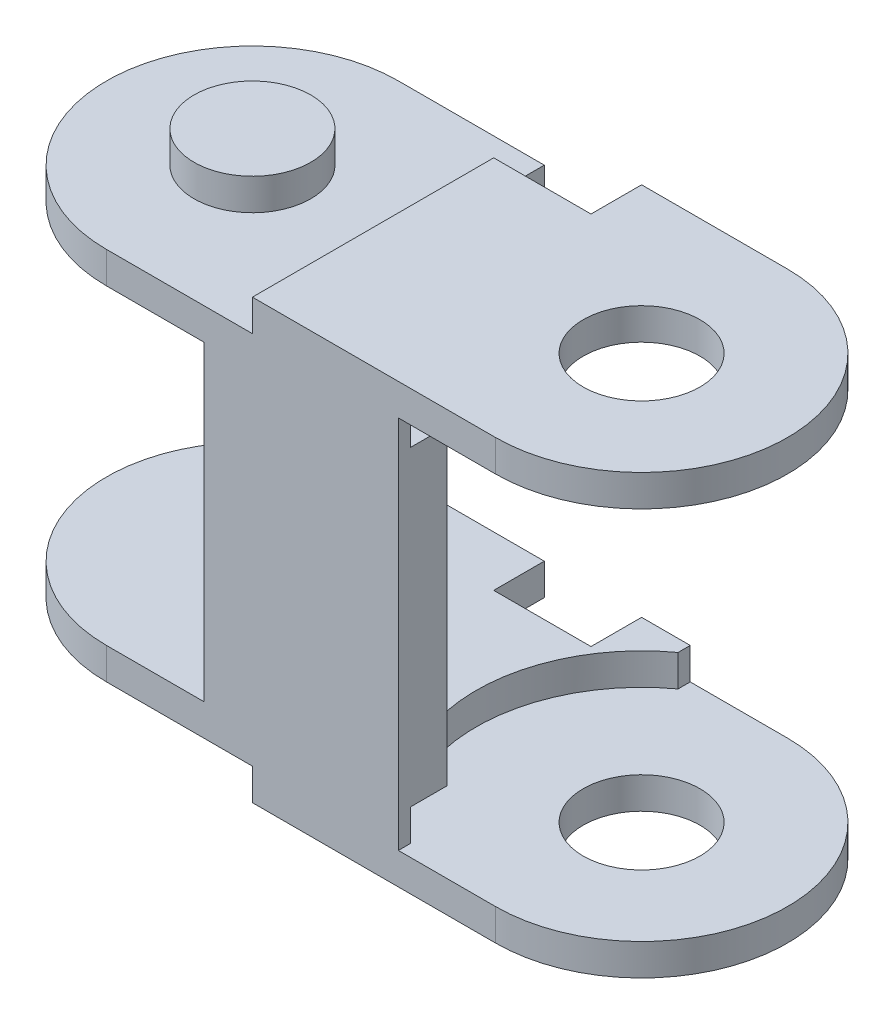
ISO-10303-21;
HEADER;
FILE_DESCRIPTION(('STEP AP214'),'2;1');
FILE_NAME('part.step','',(''),(''),'','','');
FILE_SCHEMA(('AUTOMOTIVE_DESIGN { 1 0 10303 214 1 1 1 1 }'));
ENDSEC;
DATA;
#1=APPLICATION_CONTEXT('core data for automotive mechanical design processes');
#2=APPLICATION_PROTOCOL_DEFINITION('international standard','automotive_design',2000,#1);
#3=PRODUCT_CONTEXT('',#1,'mechanical');
#4=PRODUCT('Part','Part','',(#3));
#5=PRODUCT_RELATED_PRODUCT_CATEGORY('part','',(#4));
#6=PRODUCT_DEFINITION_FORMATION('','',#4);
#7=PRODUCT_DEFINITION_CONTEXT('part definition',#1,'design');
#8=PRODUCT_DEFINITION('design','',#6,#7);
#9=PRODUCT_DEFINITION_SHAPE('','',#8);
#10=(LENGTH_UNIT() NAMED_UNIT(*) SI_UNIT(.MILLI.,.METRE.));
#11=(NAMED_UNIT(*) PLANE_ANGLE_UNIT() SI_UNIT($,.RADIAN.));
#12=(NAMED_UNIT(*) SI_UNIT($,.STERADIAN.) SOLID_ANGLE_UNIT());
#13=UNCERTAINTY_MEASURE_WITH_UNIT(LENGTH_MEASURE(1.E-05),#10,'distance_accuracy_value','');
#14=(GEOMETRIC_REPRESENTATION_CONTEXT(3) GLOBAL_UNCERTAINTY_ASSIGNED_CONTEXT((#13)) GLOBAL_UNIT_ASSIGNED_CONTEXT((#10,
#11,#12)) REPRESENTATION_CONTEXT('',''));
#15=CARTESIAN_POINT('',(0.,0.,0.));
#16=DIRECTION('',(0.,0.,1.));
#17=DIRECTION('',(1.,0.,0.));
#18=AXIS2_PLACEMENT_3D('',#15,#16,#17);
#19=CARTESIAN_POINT('',(-20.,19.25,0.));
#20=DIRECTION('',(0.,1.,0.));
#21=DIRECTION('',(0.,0.,1.));
#22=AXIS2_PLACEMENT_3D('',#19,#20,#21);
#23=PLANE('',#22);
#24=CARTESIAN_POINT('',(-20.,19.25,0.));
#25=DIRECTION('',(0.,-1.,0.));
#26=DIRECTION('',(0.,0.,-1.));
#27=AXIS2_PLACEMENT_3D('',#24,#25,#26);
#28=CIRCLE('',#27,3.);
#29=CARTESIAN_POINT('',(-20.,19.25,-3.));
#30=VERTEX_POINT('',#29);
#31=EDGE_CURVE('E19',#30,#30,#28,.T.);
#32=ORIENTED_EDGE('',*,*,#31,.F.);
#33=EDGE_LOOP('',(#32));
#34=FACE_BOUND('',#33,.T.);
#35=ADVANCED_FACE('F16',(#34),#23,.T.);
#36=CARTESIAN_POINT('',(-5.,8.,6.25));
#37=DIRECTION('',(-1.,0.,0.));
#38=DIRECTION('',(0.,0.,1.));
#39=AXIS2_PLACEMENT_3D('',#36,#37,#38);
#40=PLANE('',#39);
#41=DIRECTION('',(0.,0.,1.));
#42=VECTOR('',#41,1.);
#43=CARTESIAN_POINT('',(-5.,16.,6.25));
#44=LINE('',#43,#42);
#45=CARTESIAN_POINT('',(-5.,16.,-7.5));
#46=VERTEX_POINT('',#45);
#47=CARTESIAN_POINT('',(-5.,16.,-6.87386354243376));
#48=VERTEX_POINT('',#47);
#49=EDGE_CURVE('E176',#46,#48,#44,.T.);
#50=ORIENTED_EDGE('',*,*,#49,.F.);
#51=DIRECTION('',(0.,1.,0.));
#52=VECTOR('',#51,1.);
#53=CARTESIAN_POINT('',(-5.,19.25,-7.5));
#54=LINE('',#53,#52);
#55=CARTESIAN_POINT('',(-5.,17.625,-7.5));
#56=VERTEX_POINT('',#55);
#57=EDGE_CURVE('E284',#56,#46,#54,.F.);
#58=ORIENTED_EDGE('',*,*,#57,.F.);
#59=DIRECTION('',(0.,0.,1.));
#60=VECTOR('',#59,1.);
#61=CARTESIAN_POINT('',(-5.,17.625,6.25));
#62=LINE('',#61,#60);
#63=CARTESIAN_POINT('',(-5.,17.625,-6.87386354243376));
#64=VERTEX_POINT('',#63);
#65=EDGE_CURVE('E367',#64,#56,#62,.F.);
#66=ORIENTED_EDGE('',*,*,#65,.F.);
#67=DIRECTION('',(0.,1.,0.));
#68=VECTOR('',#67,1.);
#69=CARTESIAN_POINT('',(-5.,8.,-6.87386354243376));
#70=LINE('',#69,#68);
#71=EDGE_CURVE('E159',#64,#48,#70,.F.);
#72=ORIENTED_EDGE('',*,*,#71,.T.);
#73=EDGE_LOOP('',(#50,#58,#66,#72));
#74=FACE_BOUND('',#73,.T.);
#75=ADVANCED_FACE('F611',(#74),#40,.F.);
#76=CARTESIAN_POINT('',(-20.,-3.25,0.));
#77=DIRECTION('',(0.,-1.,0.));
#78=DIRECTION('',(0.,0.,-1.));
#79=AXIS2_PLACEMENT_3D('',#76,#77,#78);
#80=PLANE('',#79);
#81=CARTESIAN_POINT('',(-20.,-3.25,0.));
#82=DIRECTION('',(0.,-1.,0.));
#83=DIRECTION('',(0.,0.,-1.));
#84=AXIS2_PLACEMENT_3D('',#81,#82,#83);
#85=CIRCLE('',#84,3.);
#86=CARTESIAN_POINT('',(-20.,-3.25,-3.));
#87=VERTEX_POINT('',#86);
#88=EDGE_CURVE('E221',#87,#87,#85,.F.);
#89=ORIENTED_EDGE('',*,*,#88,.F.);
#90=EDGE_LOOP('',(#89));
#91=FACE_BOUND('',#90,.T.);
#92=ADVANCED_FACE('F1064',(#91),#80,.T.);
#93=CARTESIAN_POINT('',(-5.,8.,6.25));
#94=DIRECTION('',(-1.,0.,0.));
#95=DIRECTION('',(0.,0.,1.));
#96=AXIS2_PLACEMENT_3D('',#93,#94,#95);
#97=PLANE('',#96);
#98=DIRECTION('',(0.,0.,1.));
#99=VECTOR('',#98,1.);
#100=CARTESIAN_POINT('',(-5.,-1.625,6.25));
#101=LINE('',#100,#99);
#102=CARTESIAN_POINT('',(-5.,-1.625,-7.5));
#103=VERTEX_POINT('',#102);
#104=CARTESIAN_POINT('',(-5.,-1.625,-6.87386354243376));
#105=VERTEX_POINT('',#104);
#106=EDGE_CURVE('E280',#103,#105,#101,.T.);
#107=ORIENTED_EDGE('',*,*,#106,.F.);
#108=DIRECTION('',(0.,1.,0.));
#109=VECTOR('',#108,1.);
#110=CARTESIAN_POINT('',(-5.,19.25,-7.5));
#111=LINE('',#110,#109);
#112=CARTESIAN_POINT('',(-5.,0.,-7.5));
#113=VERTEX_POINT('',#112);
#114=EDGE_CURVE('E320',#113,#103,#111,.F.);
#115=ORIENTED_EDGE('',*,*,#114,.F.);
#116=DIRECTION('',(0.,0.,1.));
#117=VECTOR('',#116,1.);
#118=CARTESIAN_POINT('',(-5.,0.,6.25));
#119=LINE('',#118,#117);
#120=CARTESIAN_POINT('',(-5.,0.,-6.87386354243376));
#121=VERTEX_POINT('',#120);
#122=EDGE_CURVE('E328',#121,#113,#119,.F.);
#123=ORIENTED_EDGE('',*,*,#122,.F.);
#124=DIRECTION('',(0.,1.,0.));
#125=VECTOR('',#124,1.);
#126=CARTESIAN_POINT('',(-5.,8.,-6.87386354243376));
#127=LINE('',#126,#125);
#128=EDGE_CURVE('E226',#121,#105,#127,.F.);
#129=ORIENTED_EDGE('',*,*,#128,.T.);
#130=EDGE_LOOP('',(#107,#115,#123,#129));
#131=FACE_BOUND('',#130,.T.);
#132=ADVANCED_FACE('F549',(#131),#97,.F.);
#133=CARTESIAN_POINT('',(0.,16.,0.));
#134=DIRECTION('',(0.,-1.,0.));
#135=DIRECTION('',(0.,0.,-1.));
#136=AXIS2_PLACEMENT_3D('',#133,#134,#135);
#137=PLANE('',#136);
#138=CARTESIAN_POINT('',(0.,16.,0.));
#139=DIRECTION('',(0.,1.,0.));
#140=DIRECTION('',(0.,0.,1.));
#141=AXIS2_PLACEMENT_3D('',#138,#139,#140);
#142=CIRCLE('',#141,8.5);
#143=CARTESIAN_POINT('',(-6.87386354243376,16.,5.));
#144=VERTEX_POINT('',#143);
#145=CARTESIAN_POINT('',(-5.,16.,6.87386354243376));
#146=VERTEX_POINT('',#145);
#147=EDGE_CURVE('E138',#144,#146,#142,.T.);
#148=ORIENTED_EDGE('',*,*,#147,.T.);
#149=DIRECTION('',(0.,0.,1.));
#150=VECTOR('',#149,1.);
#151=CARTESIAN_POINT('',(-5.,16.,6.25));
#152=LINE('',#151,#150);
#153=CARTESIAN_POINT('',(-5.,16.,5.));
#154=VERTEX_POINT('',#153);
#155=EDGE_CURVE('E142',#146,#154,#152,.F.);
#156=ORIENTED_EDGE('',*,*,#155,.T.);
#157=DIRECTION('',(1.,0.,0.));
#158=VECTOR('',#157,1.);
#159=CARTESIAN_POINT('',(-10.,16.,5.));
#160=LINE('',#159,#158);
#161=EDGE_CURVE('E135',#154,#144,#160,.F.);
#162=ORIENTED_EDGE('',*,*,#161,.T.);
#163=EDGE_LOOP('',(#148,#156,#162));
#164=FACE_BOUND('',#163,.T.);
#165=ADVANCED_FACE('F137',(#164),#137,.F.);
#166=CARTESIAN_POINT('',(0.,0.,0.));
#167=DIRECTION('',(0.,1.,0.));
#168=DIRECTION('',(0.,0.,1.));
#169=AXIS2_PLACEMENT_3D('',#166,#167,#168);
#170=PLANE('',#169);
#171=DIRECTION('',(0.,0.,1.));
#172=VECTOR('',#171,1.);
#173=CARTESIAN_POINT('',(-5.,0.,6.25));
#174=LINE('',#173,#172);
#175=CARTESIAN_POINT('',(-5.,0.,5.));
#176=VERTEX_POINT('',#175);
#177=CARTESIAN_POINT('',(-5.,0.,6.87386354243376));
#178=VERTEX_POINT('',#177);
#179=EDGE_CURVE('E309',#176,#178,#174,.T.);
#180=ORIENTED_EDGE('',*,*,#179,.T.);
#181=CARTESIAN_POINT('',(0.,0.,0.));
#182=DIRECTION('',(0.,1.,0.));
#183=DIRECTION('',(0.,0.,1.));
#184=AXIS2_PLACEMENT_3D('',#181,#182,#183);
#185=CIRCLE('',#184,8.5);
#186=CARTESIAN_POINT('',(-6.87386354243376,0.,5.));
#187=VERTEX_POINT('',#186);
#188=EDGE_CURVE('E148',#178,#187,#185,.F.);
#189=ORIENTED_EDGE('',*,*,#188,.T.);
#190=DIRECTION('',(1.,0.,0.));
#191=VECTOR('',#190,1.);
#192=CARTESIAN_POINT('',(-10.,0.,5.));
#193=LINE('',#192,#191);
#194=EDGE_CURVE('E147',#187,#176,#193,.T.);
#195=ORIENTED_EDGE('',*,*,#194,.T.);
#196=EDGE_LOOP('',(#180,#189,#195));
#197=FACE_BOUND('',#196,.T.);
#198=ADVANCED_FACE('F534',(#197),#170,.F.);
#199=CARTESIAN_POINT('',(-9.99982319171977E-11,19.25,-9.99982047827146E-11));
#200=DIRECTION('',(0.,1.,0.));
#201=DIRECTION('',(0.,0.,1.));
#202=AXIS2_PLACEMENT_3D('',#199,#200,#201);
#203=CYLINDRICAL_SURFACE('',#202,7.5);
#204=CARTESIAN_POINT('',(-9.99982319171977E-11,19.25,-9.99982047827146E-11));
#205=DIRECTION('',(0.,1.,0.));
#206=DIRECTION('',(0.,0.,1.));
#207=AXIS2_PLACEMENT_3D('',#204,#205,#206);
#208=CIRCLE('',#207,7.5);
#209=CARTESIAN_POINT('',(-4.99991159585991E-11,19.25,-7.5));
#210=VERTEX_POINT('',#209);
#211=CARTESIAN_POINT('',(-9.99982319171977E-11,19.25,7.49999999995));
#212=VERTEX_POINT('',#211);
#213=EDGE_CURVE('E195',#210,#212,#208,.F.);
#214=ORIENTED_EDGE('',*,*,#213,.T.);
#215=DIRECTION('',(0.,1.,0.));
#216=VECTOR('',#215,1.);
#217=CARTESIAN_POINT('',(-9.99982319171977E-11,19.25,7.4999999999));
#218=LINE('',#217,#216);
#219=CARTESIAN_POINT('',(-9.99982319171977E-11,17.625,7.49999999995));
#220=VERTEX_POINT('',#219);
#221=EDGE_CURVE('E268',#212,#220,#218,.F.);
#222=ORIENTED_EDGE('',*,*,#221,.T.);
#223=CARTESIAN_POINT('',(-9.99982319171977E-11,17.625,-9.99982047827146E-11));
#224=DIRECTION('',(0.,1.,0.));
#225=DIRECTION('',(0.,0.,1.));
#226=AXIS2_PLACEMENT_3D('',#223,#224,#225);
#227=CIRCLE('',#226,7.5);
#228=CARTESIAN_POINT('',(-4.99991159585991E-11,17.625,-7.5));
#229=VERTEX_POINT('',#228);
#230=EDGE_CURVE('E203',#229,#220,#227,.F.);
#231=ORIENTED_EDGE('',*,*,#230,.F.);
#232=DIRECTION('',(0.,1.,0.));
#233=VECTOR('',#232,1.);
#234=CARTESIAN_POINT('',(0.,19.25,-7.5));
#235=LINE('',#234,#233);
#236=EDGE_CURVE('E232',#210,#229,#235,.F.);
#237=ORIENTED_EDGE('',*,*,#236,.F.);
#238=EDGE_LOOP('',(#214,#222,#231,#237));
#239=FACE_BOUND('',#238,.T.);
#240=ADVANCED_FACE('F629',(#239),#203,.T.);
#241=CARTESIAN_POINT('',(0.,8.,0.));
#242=DIRECTION('',(0.,1.,0.));
#243=DIRECTION('',(0.,0.,1.));
#244=AXIS2_PLACEMENT_3D('',#241,#242,#243);
#245=CYLINDRICAL_SURFACE('',#244,3.);
#246=CARTESIAN_POINT('',(0.,17.625,0.));
#247=DIRECTION('',(0.,1.,0.));
#248=DIRECTION('',(0.,0.,1.));
#249=AXIS2_PLACEMENT_3D('',#246,#247,#248);
#250=CIRCLE('',#249,3.);
#251=CARTESIAN_POINT('',(0.,17.625,3.));
#252=VERTEX_POINT('',#251);
#253=EDGE_CURVE('E199',#252,#252,#250,.T.);
#254=ORIENTED_EDGE('',*,*,#253,.F.);
#255=EDGE_LOOP('',(#254));
#256=FACE_BOUND('',#255,.T.);
#257=CARTESIAN_POINT('',(0.,19.25,0.));
#258=DIRECTION('',(0.,1.,0.));
#259=DIRECTION('',(0.,0.,1.));
#260=AXIS2_PLACEMENT_3D('',#257,#258,#259);
#261=CIRCLE('',#260,3.);
#262=CARTESIAN_POINT('',(0.,19.25,3.));
#263=VERTEX_POINT('',#262);
#264=EDGE_CURVE('E191',#263,#263,#261,.T.);
#265=ORIENTED_EDGE('',*,*,#264,.T.);
#266=EDGE_LOOP('',(#265));
#267=FACE_BOUND('',#266,.T.);
#268=ADVANCED_FACE('F1021',(#256,#267),#245,.F.);
#269=CARTESIAN_POINT('',(-12.5,18.4375,3.75));
#270=DIRECTION('',(-1.,0.,0.));
#271=DIRECTION('',(0.,0.,1.));
#272=AXIS2_PLACEMENT_3D('',#269,#270,#271);
#273=PLANE('',#272);
#274=DIRECTION('',(0.,1.,0.));
#275=VECTOR('',#274,1.);
#276=CARTESIAN_POINT('',(-12.5,18.4375,7.5));
#277=LINE('',#276,#275);
#278=CARTESIAN_POINT('',(-12.5,17.625,7.5));
#279=VERTEX_POINT('',#278);
#280=CARTESIAN_POINT('',(-12.5,19.25,7.5));
#281=VERTEX_POINT('',#280);
#282=EDGE_CURVE('E265',#279,#281,#277,.T.);
#283=ORIENTED_EDGE('',*,*,#282,.T.);
#284=DIRECTION('',(0.,0.,-1.));
#285=VECTOR('',#284,1.);
#286=CARTESIAN_POINT('',(-12.5,19.25,0.0678434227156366));
#287=LINE('',#286,#285);
#288=CARTESIAN_POINT('',(-12.5,19.25,-4.9));
#289=VERTEX_POINT('',#288);
#290=EDGE_CURVE('E194',#281,#289,#287,.T.);
#291=ORIENTED_EDGE('',*,*,#290,.T.);
#292=DIRECTION('',(0.,1.,0.));
#293=VECTOR('',#292,1.);
#294=CARTESIAN_POINT('',(-12.5,8.,-4.9));
#295=LINE('',#294,#293);
#296=CARTESIAN_POINT('',(-12.5,17.625,-4.9));
#297=VERTEX_POINT('',#296);
#298=EDGE_CURVE('E294',#297,#289,#295,.T.);
#299=ORIENTED_EDGE('',*,*,#298,.F.);
#300=DIRECTION('',(0.,0.,1.));
#301=VECTOR('',#300,1.);
#302=CARTESIAN_POINT('',(-12.5,17.625,3.75));
#303=LINE('',#302,#301);
#304=EDGE_CURVE('E189',#279,#297,#303,.F.);
#305=ORIENTED_EDGE('',*,*,#304,.F.);
#306=EDGE_LOOP('',(#283,#291,#299,#305));
#307=FACE_BOUND('',#306,.T.);
#308=ADVANCED_FACE('F1011',(#307),#273,.T.);
#309=CARTESIAN_POINT('',(-20.,18.4375,0.));
#310=DIRECTION('',(0.,-1.,0.));
#311=DIRECTION('',(0.,0.,-1.));
#312=AXIS2_PLACEMENT_3D('',#309,#310,#311);
#313=CYLINDRICAL_SURFACE('',#312,3.);
#314=CARTESIAN_POINT('',(-20.,17.625,0.));
#315=DIRECTION('',(0.,-1.,0.));
#316=DIRECTION('',(0.,0.,-1.));
#317=AXIS2_PLACEMENT_3D('',#314,#315,#316);
#318=CIRCLE('',#317,3.);
#319=CARTESIAN_POINT('',(-20.,17.625,-3.));
#320=VERTEX_POINT('',#319);
#321=EDGE_CURVE('E178',#320,#320,#318,.T.);
#322=ORIENTED_EDGE('',*,*,#321,.F.);
#323=EDGE_LOOP('',(#322));
#324=FACE_BOUND('',#323,.T.);
#325=ORIENTED_EDGE('',*,*,#31,.T.);
#326=EDGE_LOOP('',(#325));
#327=FACE_BOUND('',#326,.T.);
#328=ADVANCED_FACE('F1002',(#324,#327),#313,.T.);
#329=CARTESIAN_POINT('',(0.,8.,0.));
#330=DIRECTION('',(0.,1.,0.));
#331=DIRECTION('',(0.,0.,1.));
#332=AXIS2_PLACEMENT_3D('',#329,#330,#331);
#333=CYLINDRICAL_SURFACE('',#332,8.5);
#334=CARTESIAN_POINT('',(0.,17.625,0.));
#335=DIRECTION('',(0.,1.,0.));
#336=DIRECTION('',(0.,0.,1.));
#337=AXIS2_PLACEMENT_3D('',#334,#335,#336);
#338=CIRCLE('',#337,8.5);
#339=CARTESIAN_POINT('',(-5.,17.625,6.87386354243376));
#340=VERTEX_POINT('',#339);
#341=EDGE_CURVE('E207',#340,#64,#338,.F.);
#342=ORIENTED_EDGE('',*,*,#341,.F.);
#343=DIRECTION('',(0.,1.,0.));
#344=VECTOR('',#343,1.);
#345=CARTESIAN_POINT('',(-5.,8.,6.87386354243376));
#346=LINE('',#345,#344);
#347=EDGE_CURVE('E157',#340,#146,#346,.F.);
#348=ORIENTED_EDGE('',*,*,#347,.T.);
#349=ORIENTED_EDGE('',*,*,#147,.F.);
#350=CARTESIAN_POINT('',(0.,16.,0.));
#351=DIRECTION('',(0.,1.,0.));
#352=DIRECTION('',(0.,0.,1.));
#353=AXIS2_PLACEMENT_3D('',#350,#351,#352);
#354=CIRCLE('',#353,8.5);
#355=EDGE_CURVE('E154',#48,#144,#354,.T.);
#356=ORIENTED_EDGE('',*,*,#355,.F.);
#357=ORIENTED_EDGE('',*,*,#71,.F.);
#358=EDGE_LOOP('',(#342,#348,#349,#356,#357));
#359=FACE_BOUND('',#358,.T.);
#360=ADVANCED_FACE('F151',(#359),#333,.F.);
#361=CARTESIAN_POINT('',(-20.,19.25,0.));
#362=DIRECTION('',(0.,1.,0.));
#363=DIRECTION('',(0.,0.,1.));
#364=AXIS2_PLACEMENT_3D('',#361,#362,#363);
#365=CYLINDRICAL_SURFACE('',#364,7.5);
#366=CARTESIAN_POINT('',(-20.,16.,0.));
#367=DIRECTION('',(0.,1.,0.));
#368=DIRECTION('',(0.,0.,1.));
#369=AXIS2_PLACEMENT_3D('',#366,#367,#368);
#370=CIRCLE('',#369,7.5);
#371=CARTESIAN_POINT('',(-19.9999999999,16.,7.49999999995));
#372=VERTEX_POINT('',#371);
#373=CARTESIAN_POINT('',(-20.,16.,-7.50000000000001));
#374=VERTEX_POINT('',#373);
#375=EDGE_CURVE('E170',#372,#374,#370,.F.);
#376=ORIENTED_EDGE('',*,*,#375,.F.);
#377=DIRECTION('',(0.,1.,0.));
#378=VECTOR('',#377,1.);
#379=CARTESIAN_POINT('',(-19.9999999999,19.25,7.4999999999));
#380=LINE('',#379,#378);
#381=CARTESIAN_POINT('',(-19.9999999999,17.625,7.49999999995));
#382=VERTEX_POINT('',#381);
#383=EDGE_CURVE('E158',#372,#382,#380,.T.);
#384=ORIENTED_EDGE('',*,*,#383,.T.);
#385=CARTESIAN_POINT('',(-19.9999999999,17.625,-1.00004449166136E-10));
#386=DIRECTION('',(0.,1.,0.));
#387=DIRECTION('',(0.,0.,1.));
#388=AXIS2_PLACEMENT_3D('',#385,#386,#387);
#389=CIRCLE('',#388,7.5);
#390=CARTESIAN_POINT('',(-20.,17.625,-7.5));
#391=VERTEX_POINT('',#390);
#392=EDGE_CURVE('E186',#391,#382,#389,.T.);
#393=ORIENTED_EDGE('',*,*,#392,.F.);
#394=DIRECTION('',(0.,1.,0.));
#395=VECTOR('',#394,1.);
#396=CARTESIAN_POINT('',(-20.,19.25,-7.5));
#397=LINE('',#396,#395);
#398=EDGE_CURVE('E245',#374,#391,#397,.T.);
#399=ORIENTED_EDGE('',*,*,#398,.F.);
#400=EDGE_LOOP('',(#376,#384,#393,#399));
#401=FACE_BOUND('',#400,.T.);
#402=ADVANCED_FACE('F983',(#401),#365,.T.);
#403=CARTESIAN_POINT('',(0.,19.25,-7.5));
#404=DIRECTION('',(0.,0.,-1.));
#405=DIRECTION('',(-1.,0.,0.));
#406=AXIS2_PLACEMENT_3D('',#403,#404,#405);
#407=PLANE('',#406);
#408=ORIENTED_EDGE('',*,*,#398,.T.);
#409=DIRECTION('',(1.,0.,0.));
#410=VECTOR('',#409,1.);
#411=CARTESIAN_POINT('',(-22.5,17.625,-7.5));
#412=LINE('',#411,#410);
#413=CARTESIAN_POINT('',(-12.5,17.625,-7.5));
#414=VERTEX_POINT('',#413);
#415=EDGE_CURVE('E190',#414,#391,#412,.F.);
#416=ORIENTED_EDGE('',*,*,#415,.F.);
#417=DIRECTION('',(0.,1.,0.));
#418=VECTOR('',#417,1.);
#419=CARTESIAN_POINT('',(-12.5,8.,-7.5));
#420=LINE('',#419,#418);
#421=CARTESIAN_POINT('',(-12.5,16.,-7.50000000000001));
#422=VERTEX_POINT('',#421);
#423=EDGE_CURVE('E248',#422,#414,#420,.T.);
#424=ORIENTED_EDGE('',*,*,#423,.F.);
#425=DIRECTION('',(1.,0.,0.));
#426=VECTOR('',#425,1.);
#427=CARTESIAN_POINT('',(-23.75,16.,-7.50000000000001));
#428=LINE('',#427,#426);
#429=EDGE_CURVE('E253',#374,#422,#428,.T.);
#430=ORIENTED_EDGE('',*,*,#429,.F.);
#431=EDGE_LOOP('',(#408,#416,#424,#430));
#432=FACE_BOUND('',#431,.T.);
#433=ADVANCED_FACE('F973',(#432),#407,.T.);
#434=CARTESIAN_POINT('',(-12.5,8.,-6.2));
#435=DIRECTION('',(1.,0.,0.));
#436=DIRECTION('',(0.,0.,-1.));
#437=AXIS2_PLACEMENT_3D('',#434,#435,#436);
#438=PLANE('',#437);
#439=DIRECTION('',(0.,0.,-1.));
#440=VECTOR('',#439,1.);
#441=CARTESIAN_POINT('',(-12.5,16.,-3.));
#442=LINE('',#441,#440);
#443=CARTESIAN_POINT('',(-12.5,16.,-4.9));
#444=VERTEX_POINT('',#443);
#445=EDGE_CURVE('E249',#422,#444,#442,.F.);
#446=ORIENTED_EDGE('',*,*,#445,.F.);
#447=ORIENTED_EDGE('',*,*,#423,.T.);
#448=DIRECTION('',(0.,0.,1.));
#449=VECTOR('',#448,1.);
#450=CARTESIAN_POINT('',(-12.5,17.625,3.75));
#451=LINE('',#450,#449);
#452=EDGE_CURVE('E181',#297,#414,#451,.F.);
#453=ORIENTED_EDGE('',*,*,#452,.F.);
#454=DIRECTION('',(0.,1.,0.));
#455=VECTOR('',#454,1.);
#456=CARTESIAN_POINT('',(-12.5,8.,-4.9));
#457=LINE('',#456,#455);
#458=EDGE_CURVE('E258',#444,#297,#457,.T.);
#459=ORIENTED_EDGE('',*,*,#458,.F.);
#460=EDGE_LOOP('',(#446,#447,#453,#459));
#461=FACE_BOUND('',#460,.T.);
#462=ADVANCED_FACE('F963',(#461),#438,.T.);
#463=CARTESIAN_POINT('',(-10.,8.,-4.9));
#464=DIRECTION('',(0.,0.,-1.));
#465=DIRECTION('',(-1.,0.,0.));
#466=AXIS2_PLACEMENT_3D('',#463,#464,#465);
#467=PLANE('',#466);
#468=DIRECTION('',(1.,0.,0.));
#469=VECTOR('',#468,1.);
#470=CARTESIAN_POINT('',(-10.000000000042,19.25,-4.9));
#471=LINE('',#470,#469);
#472=CARTESIAN_POINT('',(-7.5,19.25,-4.9));
#473=VERTEX_POINT('',#472);
#474=EDGE_CURVE('E202',#289,#473,#471,.T.);
#475=ORIENTED_EDGE('',*,*,#474,.T.);
#476=DIRECTION('',(0.,1.,0.));
#477=VECTOR('',#476,1.);
#478=CARTESIAN_POINT('',(-7.5,8.,-4.9));
#479=LINE('',#478,#477);
#480=CARTESIAN_POINT('',(-7.5,16.,-4.9));
#481=VERTEX_POINT('',#480);
#482=EDGE_CURVE('E291',#481,#473,#479,.T.);
#483=ORIENTED_EDGE('',*,*,#482,.F.);
#484=DIRECTION('',(1.,0.,0.));
#485=VECTOR('',#484,1.);
#486=CARTESIAN_POINT('',(-23.75,16.,-4.9));
#487=LINE('',#486,#485);
#488=EDGE_CURVE('E252',#444,#481,#487,.T.);
#489=ORIENTED_EDGE('',*,*,#488,.F.);
#490=ORIENTED_EDGE('',*,*,#458,.T.);
#491=ORIENTED_EDGE('',*,*,#298,.T.);
#492=EDGE_LOOP('',(#475,#483,#489,#490,#491));
#493=FACE_BOUND('',#492,.T.);
#494=ADVANCED_FACE('F954',(#493),#467,.T.);
#495=CARTESIAN_POINT('',(-7.5,8.,-6.2));
#496=DIRECTION('',(-1.,0.,0.));
#497=DIRECTION('',(0.,0.,1.));
#498=AXIS2_PLACEMENT_3D('',#495,#496,#497);
#499=PLANE('',#498);
#500=DIRECTION('',(0.,0.,-1.));
#501=VECTOR('',#500,1.);
#502=CARTESIAN_POINT('',(-7.5,19.25,0.0678434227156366));
#503=LINE('',#502,#501);
#504=CARTESIAN_POINT('',(-7.5,19.25,-7.5));
#505=VERTEX_POINT('',#504);
#506=EDGE_CURVE('E277',#473,#505,#503,.T.);
#507=ORIENTED_EDGE('',*,*,#506,.T.);
#508=DIRECTION('',(0.,1.,0.));
#509=VECTOR('',#508,1.);
#510=CARTESIAN_POINT('',(-7.5,19.25,-7.5));
#511=LINE('',#510,#509);
#512=CARTESIAN_POINT('',(-7.5,16.,-7.5));
#513=VERTEX_POINT('',#512);
#514=EDGE_CURVE('E239',#513,#505,#511,.T.);
#515=ORIENTED_EDGE('',*,*,#514,.F.);
#516=DIRECTION('',(0.,0.,-1.));
#517=VECTOR('',#516,1.);
#518=CARTESIAN_POINT('',(-7.5,16.,-3.));
#519=LINE('',#518,#517);
#520=EDGE_CURVE('E361',#481,#513,#519,.T.);
#521=ORIENTED_EDGE('',*,*,#520,.F.);
#522=ORIENTED_EDGE('',*,*,#482,.T.);
#523=EDGE_LOOP('',(#507,#515,#521,#522));
#524=FACE_BOUND('',#523,.T.);
#525=ADVANCED_FACE('F619',(#524),#499,.T.);
#526=CARTESIAN_POINT('',(0.,19.25,-7.5));
#527=DIRECTION('',(0.,0.,-1.));
#528=DIRECTION('',(-1.,0.,0.));
#529=AXIS2_PLACEMENT_3D('',#526,#527,#528);
#530=PLANE('',#529);
#531=DIRECTION('',(1.,0.,0.));
#532=VECTOR('',#531,1.);
#533=CARTESIAN_POINT('',(-10.000000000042,19.25,-7.5));
#534=LINE('',#533,#532);
#535=EDGE_CURVE('E198',#505,#210,#534,.T.);
#536=ORIENTED_EDGE('',*,*,#535,.T.);
#537=ORIENTED_EDGE('',*,*,#236,.T.);
#538=DIRECTION('',(1.,0.,0.));
#539=VECTOR('',#538,1.);
#540=CARTESIAN_POINT('',(-2.5,17.625,-7.5));
#541=LINE('',#540,#539);
#542=EDGE_CURVE('E206',#56,#229,#541,.T.);
#543=ORIENTED_EDGE('',*,*,#542,.F.);
#544=ORIENTED_EDGE('',*,*,#57,.T.);
#545=DIRECTION('',(1.,0.,0.));
#546=VECTOR('',#545,1.);
#547=CARTESIAN_POINT('',(-23.75,16.,-7.5));
#548=LINE('',#547,#546);
#549=EDGE_CURVE('E359',#513,#46,#548,.T.);
#550=ORIENTED_EDGE('',*,*,#549,.F.);
#551=ORIENTED_EDGE('',*,*,#514,.T.);
#552=EDGE_LOOP('',(#536,#537,#543,#544,#550,#551));
#553=FACE_BOUND('',#552,.T.);
#554=ADVANCED_FACE('F615',(#553),#530,.T.);
#555=CARTESIAN_POINT('',(0.,8.,0.));
#556=DIRECTION('',(0.,1.,0.));
#557=DIRECTION('',(0.,0.,1.));
#558=AXIS2_PLACEMENT_3D('',#555,#556,#557);
#559=CYLINDRICAL_SURFACE('',#558,8.5);
#560=CARTESIAN_POINT('',(0.,0.,0.));
#561=DIRECTION('',(0.,1.,0.));
#562=DIRECTION('',(0.,0.,1.));
#563=AXIS2_PLACEMENT_3D('',#560,#561,#562);
#564=CIRCLE('',#563,8.5);
#565=EDGE_CURVE('E401',#121,#187,#564,.T.);
#566=ORIENTED_EDGE('',*,*,#565,.T.);
#567=ORIENTED_EDGE('',*,*,#188,.F.);
#568=DIRECTION('',(0.,1.,0.));
#569=VECTOR('',#568,1.);
#570=CARTESIAN_POINT('',(-5.,8.,6.87386354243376));
#571=LINE('',#570,#569);
#572=CARTESIAN_POINT('',(-5.,-1.625,6.87386354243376));
#573=VERTEX_POINT('',#572);
#574=EDGE_CURVE('E214',#178,#573,#571,.F.);
#575=ORIENTED_EDGE('',*,*,#574,.T.);
#576=CARTESIAN_POINT('',(0.,-1.625,0.));
#577=DIRECTION('',(0.,1.,0.));
#578=DIRECTION('',(0.,0.,1.));
#579=AXIS2_PLACEMENT_3D('',#576,#577,#578);
#580=CIRCLE('',#579,8.5);
#581=EDGE_CURVE('E216',#573,#105,#580,.F.);
#582=ORIENTED_EDGE('',*,*,#581,.T.);
#583=ORIENTED_EDGE('',*,*,#128,.F.);
#584=EDGE_LOOP('',(#566,#567,#575,#582,#583));
#585=FACE_BOUND('',#584,.T.);
#586=ADVANCED_FACE('F543',(#585),#559,.F.);
#587=CARTESIAN_POINT('',(-10.,8.,5.));
#588=DIRECTION('',(0.,0.,1.));
#589=DIRECTION('',(1.,0.,0.));
#590=AXIS2_PLACEMENT_3D('',#587,#588,#589);
#591=PLANE('',#590);
#592=DIRECTION('',(1.,0.,0.));
#593=VECTOR('',#592,1.);
#594=CARTESIAN_POINT('',(-23.75,0.,5.));
#595=LINE('',#594,#593);
#596=CARTESIAN_POINT('',(-15.,0.,5.));
#597=VERTEX_POINT('',#596);
#598=EDGE_CURVE('E402',#187,#597,#595,.F.);
#599=ORIENTED_EDGE('',*,*,#598,.T.);
#600=DIRECTION('',(0.,1.,0.));
#601=VECTOR('',#600,1.);
#602=CARTESIAN_POINT('',(-15.,8.,5.));
#603=LINE('',#602,#601);
#604=CARTESIAN_POINT('',(-15.,16.,5.));
#605=VERTEX_POINT('',#604);
#606=EDGE_CURVE('E166',#597,#605,#603,.T.);
#607=ORIENTED_EDGE('',*,*,#606,.T.);
#608=DIRECTION('',(1.,0.,0.));
#609=VECTOR('',#608,1.);
#610=CARTESIAN_POINT('',(-23.75,16.,5.));
#611=LINE('',#610,#609);
#612=EDGE_CURVE('E162',#144,#605,#611,.F.);
#613=ORIENTED_EDGE('',*,*,#612,.F.);
#614=ORIENTED_EDGE('',*,*,#161,.F.);
#615=DIRECTION('',(0.,1.,0.));
#616=VECTOR('',#615,1.);
#617=CARTESIAN_POINT('',(-5.,8.,5.));
#618=LINE('',#617,#616);
#619=EDGE_CURVE('E311',#154,#176,#618,.F.);
#620=ORIENTED_EDGE('',*,*,#619,.T.);
#621=ORIENTED_EDGE('',*,*,#194,.F.);
#622=EDGE_LOOP('',(#599,#607,#613,#614,#620,#621));
#623=FACE_BOUND('',#622,.T.);
#624=ADVANCED_FACE('F164',(#623),#591,.F.);
#625=CARTESIAN_POINT('',(-20.,19.25,0.));
#626=DIRECTION('',(0.,1.,0.));
#627=DIRECTION('',(0.,0.,1.));
#628=AXIS2_PLACEMENT_3D('',#625,#626,#627);
#629=CYLINDRICAL_SURFACE('',#628,7.5);
#630=CARTESIAN_POINT('',(-20.,0.,0.));
#631=DIRECTION('',(0.,1.,0.));
#632=DIRECTION('',(0.,0.,1.));
#633=AXIS2_PLACEMENT_3D('',#630,#631,#632);
#634=CIRCLE('',#633,7.5);
#635=CARTESIAN_POINT('',(-19.9999999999,0.,7.49999999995));
#636=VERTEX_POINT('',#635);
#637=CARTESIAN_POINT('',(-20.,0.,-7.50000000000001));
#638=VERTEX_POINT('',#637);
#639=EDGE_CURVE('E398',#636,#638,#634,.F.);
#640=ORIENTED_EDGE('',*,*,#639,.T.);
#641=DIRECTION('',(0.,1.,0.));
#642=VECTOR('',#641,1.);
#643=CARTESIAN_POINT('',(-20.,19.25,-7.5));
#644=LINE('',#643,#642);
#645=CARTESIAN_POINT('',(-20.,-1.625,-7.5));
#646=VERTEX_POINT('',#645);
#647=EDGE_CURVE('E521',#646,#638,#644,.T.);
#648=ORIENTED_EDGE('',*,*,#647,.F.);
#649=CARTESIAN_POINT('',(-20.,-1.625,0.));
#650=DIRECTION('',(0.,1.,0.));
#651=DIRECTION('',(0.,0.,1.));
#652=AXIS2_PLACEMENT_3D('',#649,#650,#651);
#653=CIRCLE('',#652,7.5);
#654=CARTESIAN_POINT('',(-19.9999999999,-1.625,7.49999999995));
#655=VERTEX_POINT('',#654);
#656=EDGE_CURVE('E338',#655,#646,#653,.F.);
#657=ORIENTED_EDGE('',*,*,#656,.F.);
#658=DIRECTION('',(0.,1.,0.));
#659=VECTOR('',#658,1.);
#660=CARTESIAN_POINT('',(-19.9999999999,19.25,7.4999999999));
#661=LINE('',#660,#659);
#662=EDGE_CURVE('E526',#655,#636,#661,.T.);
#663=ORIENTED_EDGE('',*,*,#662,.T.);
#664=EDGE_LOOP('',(#640,#648,#657,#663));
#665=FACE_BOUND('',#664,.T.);
#666=ADVANCED_FACE('F692',(#665),#629,.T.);
#667=CARTESIAN_POINT('',(0.,19.25,-7.5));
#668=DIRECTION('',(0.,0.,-1.));
#669=DIRECTION('',(-1.,0.,0.));
#670=AXIS2_PLACEMENT_3D('',#667,#668,#669);
#671=PLANE('',#670);
#672=ORIENTED_EDGE('',*,*,#647,.T.);
#673=DIRECTION('',(1.,0.,0.));
#674=VECTOR('',#673,1.);
#675=CARTESIAN_POINT('',(-23.75,0.,-7.50000000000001));
#676=LINE('',#675,#674);
#677=CARTESIAN_POINT('',(-12.5,0.,-7.5));
#678=VERTEX_POINT('',#677);
#679=EDGE_CURVE('E399',#638,#678,#676,.T.);
#680=ORIENTED_EDGE('',*,*,#679,.T.);
#681=DIRECTION('',(0.,1.,0.));
#682=VECTOR('',#681,1.);
#683=CARTESIAN_POINT('',(-12.5,8.,-7.5));
#684=LINE('',#683,#682);
#685=CARTESIAN_POINT('',(-12.5,-1.625,-7.5));
#686=VERTEX_POINT('',#685);
#687=EDGE_CURVE('E225',#686,#678,#684,.T.);
#688=ORIENTED_EDGE('',*,*,#687,.F.);
#689=DIRECTION('',(1.,0.,0.));
#690=VECTOR('',#689,1.);
#691=CARTESIAN_POINT('',(-22.5,-1.625,-7.5));
#692=LINE('',#691,#690);
#693=EDGE_CURVE('E397',#646,#686,#692,.T.);
#694=ORIENTED_EDGE('',*,*,#693,.F.);
#695=EDGE_LOOP('',(#672,#680,#688,#694));
#696=FACE_BOUND('',#695,.T.);
#697=ADVANCED_FACE('F903',(#696),#671,.T.);
#698=CARTESIAN_POINT('',(-12.5,8.,-6.2));
#699=DIRECTION('',(1.,0.,0.));
#700=DIRECTION('',(0.,0.,-1.));
#701=AXIS2_PLACEMENT_3D('',#698,#699,#700);
#702=PLANE('',#701);
#703=DIRECTION('',(0.,0.,-1.));
#704=VECTOR('',#703,1.);
#705=CARTESIAN_POINT('',(-12.5,0.,-3.));
#706=LINE('',#705,#704);
#707=CARTESIAN_POINT('',(-12.5,0.,-4.9));
#708=VERTEX_POINT('',#707);
#709=EDGE_CURVE('E349',#678,#708,#706,.F.);
#710=ORIENTED_EDGE('',*,*,#709,.T.);
#711=DIRECTION('',(0.,1.,0.));
#712=VECTOR('',#711,1.);
#713=CARTESIAN_POINT('',(-12.5,8.,-4.9));
#714=LINE('',#713,#712);
#715=CARTESIAN_POINT('',(-12.5,-1.625,-4.9));
#716=VERTEX_POINT('',#715);
#717=EDGE_CURVE('E352',#716,#708,#714,.T.);
#718=ORIENTED_EDGE('',*,*,#717,.F.);
#719=DIRECTION('',(0.,0.,-1.));
#720=VECTOR('',#719,1.);
#721=CARTESIAN_POINT('',(-12.5,-1.625,3.75));
#722=LINE('',#721,#720);
#723=EDGE_CURVE('E514',#686,#716,#722,.F.);
#724=ORIENTED_EDGE('',*,*,#723,.F.);
#725=ORIENTED_EDGE('',*,*,#687,.T.);
#726=EDGE_LOOP('',(#710,#718,#724,#725));
#727=FACE_BOUND('',#726,.T.);
#728=ADVANCED_FACE('F893',(#727),#702,.T.);
#729=CARTESIAN_POINT('',(-20.,-2.4375,0.));
#730=DIRECTION('',(0.,-1.,0.));
#731=DIRECTION('',(0.,0.,-1.));
#732=AXIS2_PLACEMENT_3D('',#729,#730,#731);
#733=CYLINDRICAL_SURFACE('',#732,3.);
#734=CARTESIAN_POINT('',(-20.,-1.625,0.));
#735=DIRECTION('',(0.,-1.,0.));
#736=DIRECTION('',(0.,0.,-1.));
#737=AXIS2_PLACEMENT_3D('',#734,#735,#736);
#738=CIRCLE('',#737,3.);
#739=CARTESIAN_POINT('',(-20.,-1.625,-3.));
#740=VERTEX_POINT('',#739);
#741=EDGE_CURVE('E391',#740,#740,#738,.F.);
#742=ORIENTED_EDGE('',*,*,#741,.F.);
#743=EDGE_LOOP('',(#742));
#744=FACE_BOUND('',#743,.T.);
#745=ORIENTED_EDGE('',*,*,#88,.T.);
#746=EDGE_LOOP('',(#745));
#747=FACE_BOUND('',#746,.T.);
#748=ADVANCED_FACE('F883',(#744,#747),#733,.T.);
#749=CARTESIAN_POINT('',(0.,8.,0.));
#750=DIRECTION('',(0.,1.,0.));
#751=DIRECTION('',(0.,0.,1.));
#752=AXIS2_PLACEMENT_3D('',#749,#750,#751);
#753=CYLINDRICAL_SURFACE('',#752,3.);
#754=CARTESIAN_POINT('',(0.,-3.25,0.));
#755=DIRECTION('',(0.,1.,0.));
#756=DIRECTION('',(0.,0.,1.));
#757=AXIS2_PLACEMENT_3D('',#754,#755,#756);
#758=CIRCLE('',#757,3.);
#759=CARTESIAN_POINT('',(0.,-3.25,3.));
#760=VERTEX_POINT('',#759);
#761=EDGE_CURVE('E387',#760,#760,#758,.T.);
#762=ORIENTED_EDGE('',*,*,#761,.F.);
#763=EDGE_LOOP('',(#762));
#764=FACE_BOUND('',#763,.T.);
#765=CARTESIAN_POINT('',(0.,-1.625,0.));
#766=DIRECTION('',(0.,1.,0.));
#767=DIRECTION('',(0.,0.,1.));
#768=AXIS2_PLACEMENT_3D('',#765,#766,#767);
#769=CIRCLE('',#768,3.);
#770=CARTESIAN_POINT('',(0.,-1.625,3.));
#771=VERTEX_POINT('',#770);
#772=EDGE_CURVE('E211',#771,#771,#769,.T.);
#773=ORIENTED_EDGE('',*,*,#772,.T.);
#774=EDGE_LOOP('',(#773));
#775=FACE_BOUND('',#774,.T.);
#776=ADVANCED_FACE('F874',(#764,#775),#753,.F.);
#777=CARTESIAN_POINT('',(-12.5,-2.4375,3.75));
#778=DIRECTION('',(-1.,0.,0.));
#779=DIRECTION('',(0.,0.,1.));
#780=AXIS2_PLACEMENT_3D('',#777,#778,#779);
#781=PLANE('',#780);
#782=DIRECTION('',(0.,1.,0.));
#783=VECTOR('',#782,1.);
#784=CARTESIAN_POINT('',(-12.5,-2.4375,7.5));
#785=LINE('',#784,#783);
#786=CARTESIAN_POINT('',(-12.5,-3.25,7.5));
#787=VERTEX_POINT('',#786);
#788=CARTESIAN_POINT('',(-12.5,-1.625,7.5));
#789=VERTEX_POINT('',#788);
#790=EDGE_CURVE('E224',#787,#789,#785,.T.);
#791=ORIENTED_EDGE('',*,*,#790,.T.);
#792=DIRECTION('',(0.,0.,-1.));
#793=VECTOR('',#792,1.);
#794=CARTESIAN_POINT('',(-12.5,-1.625,3.75));
#795=LINE('',#794,#793);
#796=EDGE_CURVE('E394',#716,#789,#795,.F.);
#797=ORIENTED_EDGE('',*,*,#796,.F.);
#798=DIRECTION('',(0.,1.,0.));
#799=VECTOR('',#798,1.);
#800=CARTESIAN_POINT('',(-12.5,8.,-4.9));
#801=LINE('',#800,#799);
#802=CARTESIAN_POINT('',(-12.5,-3.25,-4.9));
#803=VERTEX_POINT('',#802);
#804=EDGE_CURVE('E356',#803,#716,#801,.T.);
#805=ORIENTED_EDGE('',*,*,#804,.F.);
#806=DIRECTION('',(0.,0.,-1.));
#807=VECTOR('',#806,1.);
#808=CARTESIAN_POINT('',(-12.5,-3.25,0.067843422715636));
#809=LINE('',#808,#807);
#810=EDGE_CURVE('E390',#787,#803,#809,.T.);
#811=ORIENTED_EDGE('',*,*,#810,.F.);
#812=EDGE_LOOP('',(#791,#797,#805,#811));
#813=FACE_BOUND('',#812,.T.);
#814=ADVANCED_FACE('F699',(#813),#781,.T.);
#815=CARTESIAN_POINT('',(-10.,8.,-4.9));
#816=DIRECTION('',(0.,0.,-1.));
#817=DIRECTION('',(-1.,0.,0.));
#818=AXIS2_PLACEMENT_3D('',#815,#816,#817);
#819=PLANE('',#818);
#820=ORIENTED_EDGE('',*,*,#804,.T.);
#821=ORIENTED_EDGE('',*,*,#717,.T.);
#822=DIRECTION('',(1.,0.,0.));
#823=VECTOR('',#822,1.);
#824=CARTESIAN_POINT('',(-23.75,0.,-4.9));
#825=LINE('',#824,#823);
#826=CARTESIAN_POINT('',(-7.5,0.,-4.9));
#827=VERTEX_POINT('',#826);
#828=EDGE_CURVE('E344',#708,#827,#825,.T.);
#829=ORIENTED_EDGE('',*,*,#828,.T.);
#830=DIRECTION('',(0.,1.,0.));
#831=VECTOR('',#830,1.);
#832=CARTESIAN_POINT('',(-7.5,8.,-4.9));
#833=LINE('',#832,#831);
#834=CARTESIAN_POINT('',(-7.5,-3.25,-4.9));
#835=VERTEX_POINT('',#834);
#836=EDGE_CURVE('E355',#835,#827,#833,.T.);
#837=ORIENTED_EDGE('',*,*,#836,.F.);
#838=DIRECTION('',(1.,0.,0.));
#839=VECTOR('',#838,1.);
#840=CARTESIAN_POINT('',(-10.000000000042,-3.25,-4.9));
#841=LINE('',#840,#839);
#842=EDGE_CURVE('E495',#803,#835,#841,.T.);
#843=ORIENTED_EDGE('',*,*,#842,.F.);
#844=EDGE_LOOP('',(#820,#821,#829,#837,#843));
#845=FACE_BOUND('',#844,.T.);
#846=ADVANCED_FACE('F703',(#845),#819,.T.);
#847=CARTESIAN_POINT('',(-7.5,8.,-6.2));
#848=DIRECTION('',(-1.,0.,0.));
#849=DIRECTION('',(0.,0.,1.));
#850=AXIS2_PLACEMENT_3D('',#847,#848,#849);
#851=PLANE('',#850);
#852=DIRECTION('',(0.,0.,-1.));
#853=VECTOR('',#852,1.);
#854=CARTESIAN_POINT('',(-7.5,-3.25,0.067843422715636));
#855=LINE('',#854,#853);
#856=CARTESIAN_POINT('',(-7.5,-3.25,-7.5));
#857=VERTEX_POINT('',#856);
#858=EDGE_CURVE('E492',#835,#857,#855,.T.);
#859=ORIENTED_EDGE('',*,*,#858,.F.);
#860=ORIENTED_EDGE('',*,*,#836,.T.);
#861=DIRECTION('',(0.,0.,-1.));
#862=VECTOR('',#861,1.);
#863=CARTESIAN_POINT('',(-7.5,0.,-3.));
#864=LINE('',#863,#862);
#865=CARTESIAN_POINT('',(-7.5,0.,-7.5));
#866=VERTEX_POINT('',#865);
#867=EDGE_CURVE('E339',#827,#866,#864,.T.);
#868=ORIENTED_EDGE('',*,*,#867,.T.);
#869=DIRECTION('',(0.,1.,0.));
#870=VECTOR('',#869,1.);
#871=CARTESIAN_POINT('',(-7.5,19.25,-7.5));
#872=LINE('',#871,#870);
#873=EDGE_CURVE('E324',#857,#866,#872,.T.);
#874=ORIENTED_EDGE('',*,*,#873,.F.);
#875=EDGE_LOOP('',(#859,#860,#868,#874));
#876=FACE_BOUND('',#875,.T.);
#877=ADVANCED_FACE('F704',(#876),#851,.T.);
#878=CARTESIAN_POINT('',(0.,19.25,-7.5));
#879=DIRECTION('',(0.,0.,-1.));
#880=DIRECTION('',(-1.,0.,0.));
#881=AXIS2_PLACEMENT_3D('',#878,#879,#880);
#882=PLANE('',#881);
#883=DIRECTION('',(1.,0.,0.));
#884=VECTOR('',#883,1.);
#885=CARTESIAN_POINT('',(-23.75,0.,-7.5));
#886=LINE('',#885,#884);
#887=EDGE_CURVE('E335',#866,#113,#886,.T.);
#888=ORIENTED_EDGE('',*,*,#887,.T.);
#889=ORIENTED_EDGE('',*,*,#114,.T.);
#890=DIRECTION('',(1.,0.,0.));
#891=VECTOR('',#890,1.);
#892=CARTESIAN_POINT('',(-2.5,-1.625,-7.5));
#893=LINE('',#892,#891);
#894=CARTESIAN_POINT('',(-4.99996559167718E-11,-1.625,-7.49999999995));
#895=VERTEX_POINT('',#894);
#896=EDGE_CURVE('E215',#103,#895,#893,.T.);
#897=ORIENTED_EDGE('',*,*,#896,.T.);
#898=DIRECTION('',(0.,1.,0.));
#899=VECTOR('',#898,1.);
#900=CARTESIAN_POINT('',(0.,19.25,-7.4999999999));
#901=LINE('',#900,#899);
#902=CARTESIAN_POINT('',(-4.99996559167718E-11,-3.25,-7.49999999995));
#903=VERTEX_POINT('',#902);
#904=EDGE_CURVE('E323',#903,#895,#901,.T.);
#905=ORIENTED_EDGE('',*,*,#904,.F.);
#906=DIRECTION('',(1.,0.,0.));
#907=VECTOR('',#906,1.);
#908=CARTESIAN_POINT('',(-10.000000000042,-3.25,-7.5));
#909=LINE('',#908,#907);
#910=EDGE_CURVE('E386',#857,#903,#909,.T.);
#911=ORIENTED_EDGE('',*,*,#910,.F.);
#912=ORIENTED_EDGE('',*,*,#873,.T.);
#913=EDGE_LOOP('',(#888,#889,#897,#905,#911,#912));
#914=FACE_BOUND('',#913,.T.);
#915=ADVANCED_FACE('F552',(#914),#882,.T.);
#916=CARTESIAN_POINT('',(-9.99982319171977E-11,19.25,-9.99982047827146E-11));
#917=DIRECTION('',(0.,1.,0.));
#918=DIRECTION('',(0.,0.,1.));
#919=AXIS2_PLACEMENT_3D('',#916,#917,#918);
#920=CYLINDRICAL_SURFACE('',#919,7.5);
#921=CARTESIAN_POINT('',(-9.99982319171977E-11,-3.25,-9.99982047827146E-11));
#922=DIRECTION('',(0.,1.,0.));
#923=DIRECTION('',(0.,0.,1.));
#924=AXIS2_PLACEMENT_3D('',#921,#922,#923);
#925=CIRCLE('',#924,7.5);
#926=CARTESIAN_POINT('',(-9.99982319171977E-11,-3.25,7.49999999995));
#927=VERTEX_POINT('',#926);
#928=EDGE_CURVE('E383',#903,#927,#925,.F.);
#929=ORIENTED_EDGE('',*,*,#928,.F.);
#930=ORIENTED_EDGE('',*,*,#904,.T.);
#931=CARTESIAN_POINT('',(-9.99982319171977E-11,-1.625,-9.99982047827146E-11));
#932=DIRECTION('',(0.,1.,0.));
#933=DIRECTION('',(0.,0.,1.));
#934=AXIS2_PLACEMENT_3D('',#931,#932,#933);
#935=CIRCLE('',#934,7.5);
#936=CARTESIAN_POINT('',(-9.99982319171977E-11,-1.625,7.49999999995));
#937=VERTEX_POINT('',#936);
#938=EDGE_CURVE('E219',#895,#937,#935,.F.);
#939=ORIENTED_EDGE('',*,*,#938,.T.);
#940=DIRECTION('',(0.,1.,0.));
#941=VECTOR('',#940,1.);
#942=CARTESIAN_POINT('',(-9.99982319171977E-11,19.25,7.4999999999));
#943=LINE('',#942,#941);
#944=EDGE_CURVE('E34',#937,#927,#943,.F.);
#945=ORIENTED_EDGE('',*,*,#944,.T.);
#946=EDGE_LOOP('',(#929,#930,#939,#945));
#947=FACE_BOUND('',#946,.T.);
#948=ADVANCED_FACE('F636',(#947),#920,.T.);
#949=CARTESIAN_POINT('',(-2.5,-1.625,-2.25));
#950=DIRECTION('',(0.,-1.,0.));
#951=DIRECTION('',(0.,0.,-1.));
#952=AXIS2_PLACEMENT_3D('',#949,#950,#951);
#953=PLANE('',#952);
#954=ORIENTED_EDGE('',*,*,#772,.F.);
#955=EDGE_LOOP('',(#954));
#956=FACE_BOUND('',#955,.T.);
#957=ORIENTED_EDGE('',*,*,#106,.T.);
#958=ORIENTED_EDGE('',*,*,#581,.F.);
#959=DIRECTION('',(0.,0.,1.));
#960=VECTOR('',#959,1.);
#961=CARTESIAN_POINT('',(-5.,-1.625,6.25));
#962=LINE('',#961,#960);
#963=CARTESIAN_POINT('',(-5.,-1.625,7.5));
#964=VERTEX_POINT('',#963);
#965=EDGE_CURVE('E306',#573,#964,#962,.T.);
#966=ORIENTED_EDGE('',*,*,#965,.T.);
#967=DIRECTION('',(1.,0.,0.));
#968=VECTOR('',#967,1.);
#969=CARTESIAN_POINT('',(-5.,-1.625,7.5));
#970=LINE('',#969,#968);
#971=EDGE_CURVE('E385',#937,#964,#970,.F.);
#972=ORIENTED_EDGE('',*,*,#971,.F.);
#973=ORIENTED_EDGE('',*,*,#938,.F.);
#974=ORIENTED_EDGE('',*,*,#896,.F.);
#975=EDGE_LOOP('',(#957,#958,#966,#972,#973,#974));
#976=FACE_BOUND('',#975,.T.);
#977=ADVANCED_FACE('F545',(#956,#976),#953,.F.);
#978=CARTESIAN_POINT('',(-5.,8.,6.25));
#979=DIRECTION('',(-1.,0.,0.));
#980=DIRECTION('',(0.,0.,1.));
#981=AXIS2_PLACEMENT_3D('',#978,#979,#980);
#982=PLANE('',#981);
#983=ORIENTED_EDGE('',*,*,#619,.F.);
#984=ORIENTED_EDGE('',*,*,#155,.F.);
#985=ORIENTED_EDGE('',*,*,#347,.F.);
#986=DIRECTION('',(0.,0.,-1.));
#987=VECTOR('',#986,1.);
#988=CARTESIAN_POINT('',(-5.,17.625,-2.25));
#989=LINE('',#988,#987);
#990=CARTESIAN_POINT('',(-5.,17.625,7.5));
#991=VERTEX_POINT('',#990);
#992=EDGE_CURVE('E210',#991,#340,#989,.T.);
#993=ORIENTED_EDGE('',*,*,#992,.F.);
#994=DIRECTION('',(0.,1.,0.));
#995=VECTOR('',#994,1.);
#996=CARTESIAN_POINT('',(-5.,19.25,7.5));
#997=LINE('',#996,#995);
#998=EDGE_CURVE('E466',#964,#991,#997,.T.);
#999=ORIENTED_EDGE('',*,*,#998,.F.);
#1000=ORIENTED_EDGE('',*,*,#965,.F.);
#1001=ORIENTED_EDGE('',*,*,#574,.F.);
#1002=ORIENTED_EDGE('',*,*,#179,.F.);
#1003=EDGE_LOOP('',(#983,#984,#985,#993,#999,#1000,#1001,#1002));
#1004=FACE_BOUND('',#1003,.T.);
#1005=ADVANCED_FACE('F540',(#1004),#982,.F.);
#1006=CARTESIAN_POINT('',(-2.5,17.625,-2.25));
#1007=DIRECTION('',(0.,-1.,0.));
#1008=DIRECTION('',(0.,0.,-1.));
#1009=AXIS2_PLACEMENT_3D('',#1006,#1007,#1008);
#1010=PLANE('',#1009);
#1011=ORIENTED_EDGE('',*,*,#253,.T.);
#1012=EDGE_LOOP('',(#1011));
#1013=FACE_BOUND('',#1012,.T.);
#1014=ORIENTED_EDGE('',*,*,#542,.T.);
#1015=ORIENTED_EDGE('',*,*,#230,.T.);
#1016=DIRECTION('',(1.,0.,0.));
#1017=VECTOR('',#1016,1.);
#1018=CARTESIAN_POINT('',(-5.,17.625,7.5));
#1019=LINE('',#1018,#1017);
#1020=EDGE_CURVE('E449',#991,#220,#1019,.T.);
#1021=ORIENTED_EDGE('',*,*,#1020,.F.);
#1022=ORIENTED_EDGE('',*,*,#992,.T.);
#1023=ORIENTED_EDGE('',*,*,#341,.T.);
#1024=ORIENTED_EDGE('',*,*,#65,.T.);
#1025=EDGE_LOOP('',(#1014,#1015,#1021,#1022,#1023,#1024));
#1026=FACE_BOUND('',#1025,.T.);
#1027=ADVANCED_FACE('F631',(#1013,#1026),#1010,.T.);
#1028=CARTESIAN_POINT('',(-10.000000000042,19.25,0.0678434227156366));
#1029=DIRECTION('',(0.,-1.,0.));
#1030=DIRECTION('',(0.,0.,-1.));
#1031=AXIS2_PLACEMENT_3D('',#1028,#1029,#1030);
#1032=PLANE('',#1031);
#1033=ORIENTED_EDGE('',*,*,#264,.F.);
#1034=EDGE_LOOP('',(#1033));
#1035=FACE_BOUND('',#1034,.T.);
#1036=DIRECTION('',(1.,0.,0.));
#1037=VECTOR('',#1036,1.);
#1038=CARTESIAN_POINT('',(-5.,19.25,7.5));
#1039=LINE('',#1038,#1037);
#1040=EDGE_CURVE('E436',#212,#281,#1039,.F.);
#1041=ORIENTED_EDGE('',*,*,#1040,.F.);
#1042=ORIENTED_EDGE('',*,*,#213,.F.);
#1043=ORIENTED_EDGE('',*,*,#535,.F.);
#1044=ORIENTED_EDGE('',*,*,#506,.F.);
#1045=ORIENTED_EDGE('',*,*,#474,.F.);
#1046=ORIENTED_EDGE('',*,*,#290,.F.);
#1047=EDGE_LOOP('',(#1041,#1042,#1043,#1044,#1045,#1046));
#1048=FACE_BOUND('',#1047,.T.);
#1049=ADVANCED_FACE('F624',(#1035,#1048),#1032,.F.);
#1050=CARTESIAN_POINT('',(-22.5,17.625,3.75));
#1051=DIRECTION('',(0.,1.,0.));
#1052=DIRECTION('',(0.,0.,1.));
#1053=AXIS2_PLACEMENT_3D('',#1050,#1051,#1052);
#1054=PLANE('',#1053);
#1055=ORIENTED_EDGE('',*,*,#321,.T.);
#1056=EDGE_LOOP('',(#1055));
#1057=FACE_BOUND('',#1056,.T.);
#1058=ORIENTED_EDGE('',*,*,#304,.T.);
#1059=ORIENTED_EDGE('',*,*,#452,.T.);
#1060=ORIENTED_EDGE('',*,*,#415,.T.);
#1061=ORIENTED_EDGE('',*,*,#392,.T.);
#1062=DIRECTION('',(1.,0.,0.));
#1063=VECTOR('',#1062,1.);
#1064=CARTESIAN_POINT('',(-5.,17.625,7.5));
#1065=LINE('',#1064,#1063);
#1066=EDGE_CURVE('E421',#279,#382,#1065,.F.);
#1067=ORIENTED_EDGE('',*,*,#1066,.F.);
#1068=EDGE_LOOP('',(#1058,#1059,#1060,#1061,#1067));
#1069=FACE_BOUND('',#1068,.T.);
#1070=ADVANCED_FACE('F730',(#1057,#1069),#1054,.T.);
#1071=CARTESIAN_POINT('',(-23.75,16.,-3.));
#1072=DIRECTION('',(0.,-1.,0.));
#1073=DIRECTION('',(0.,0.,-1.));
#1074=AXIS2_PLACEMENT_3D('',#1071,#1072,#1073);
#1075=PLANE('',#1074);
#1076=ORIENTED_EDGE('',*,*,#520,.T.);
#1077=ORIENTED_EDGE('',*,*,#549,.T.);
#1078=ORIENTED_EDGE('',*,*,#49,.T.);
#1079=ORIENTED_EDGE('',*,*,#355,.T.);
#1080=ORIENTED_EDGE('',*,*,#612,.T.);
#1081=DIRECTION('',(0.,0.,-1.));
#1082=VECTOR('',#1081,1.);
#1083=CARTESIAN_POINT('',(-15.,16.,6.25));
#1084=LINE('',#1083,#1082);
#1085=CARTESIAN_POINT('',(-15.,16.,7.5));
#1086=VERTEX_POINT('',#1085);
#1087=EDGE_CURVE('E403',#605,#1086,#1084,.F.);
#1088=ORIENTED_EDGE('',*,*,#1087,.T.);
#1089=DIRECTION('',(1.,0.,0.));
#1090=VECTOR('',#1089,1.);
#1091=CARTESIAN_POINT('',(-5.,16.,7.5));
#1092=LINE('',#1091,#1090);
#1093=EDGE_CURVE('E417',#372,#1086,#1092,.T.);
#1094=ORIENTED_EDGE('',*,*,#1093,.F.);
#1095=ORIENTED_EDGE('',*,*,#375,.T.);
#1096=ORIENTED_EDGE('',*,*,#429,.T.);
#1097=ORIENTED_EDGE('',*,*,#445,.T.);
#1098=ORIENTED_EDGE('',*,*,#488,.T.);
#1099=EDGE_LOOP('',(#1076,#1077,#1078,#1079,#1080,#1088,#1094,#1095,#1096,#1097,#1098));
#1100=FACE_BOUND('',#1099,.T.);
#1101=ADVANCED_FACE('F173',(#1100),#1075,.T.);
#1102=CARTESIAN_POINT('',(-15.,8.,6.25));
#1103=DIRECTION('',(1.,0.,0.));
#1104=DIRECTION('',(0.,0.,-1.));
#1105=AXIS2_PLACEMENT_3D('',#1102,#1103,#1104);
#1106=PLANE('',#1105);
#1107=ORIENTED_EDGE('',*,*,#606,.F.);
#1108=DIRECTION('',(0.,0.,-1.));
#1109=VECTOR('',#1108,1.);
#1110=CARTESIAN_POINT('',(-15.,0.,-3.));
#1111=LINE('',#1110,#1109);
#1112=CARTESIAN_POINT('',(-15.,0.,7.5));
#1113=VERTEX_POINT('',#1112);
#1114=EDGE_CURVE('E400',#597,#1113,#1111,.F.);
#1115=ORIENTED_EDGE('',*,*,#1114,.T.);
#1116=DIRECTION('',(0.,1.,0.));
#1117=VECTOR('',#1116,1.);
#1118=CARTESIAN_POINT('',(-15.,19.25,7.5));
#1119=LINE('',#1118,#1117);
#1120=EDGE_CURVE('E420',#1086,#1113,#1119,.F.);
#1121=ORIENTED_EDGE('',*,*,#1120,.F.);
#1122=ORIENTED_EDGE('',*,*,#1087,.F.);
#1123=EDGE_LOOP('',(#1107,#1115,#1121,#1122));
#1124=FACE_BOUND('',#1123,.T.);
#1125=ADVANCED_FACE('F684',(#1124),#1106,.F.);
#1126=CARTESIAN_POINT('',(-23.75,0.,-3.));
#1127=DIRECTION('',(0.,-1.,0.));
#1128=DIRECTION('',(0.,0.,-1.));
#1129=AXIS2_PLACEMENT_3D('',#1126,#1127,#1128);
#1130=PLANE('',#1129);
#1131=ORIENTED_EDGE('',*,*,#887,.F.);
#1132=ORIENTED_EDGE('',*,*,#867,.F.);
#1133=ORIENTED_EDGE('',*,*,#828,.F.);
#1134=ORIENTED_EDGE('',*,*,#709,.F.);
#1135=ORIENTED_EDGE('',*,*,#679,.F.);
#1136=ORIENTED_EDGE('',*,*,#639,.F.);
#1137=DIRECTION('',(1.,0.,0.));
#1138=VECTOR('',#1137,1.);
#1139=CARTESIAN_POINT('',(-5.,0.,7.5));
#1140=LINE('',#1139,#1138);
#1141=EDGE_CURVE('E659',#1113,#636,#1140,.F.);
#1142=ORIENTED_EDGE('',*,*,#1141,.F.);
#1143=ORIENTED_EDGE('',*,*,#1114,.F.);
#1144=ORIENTED_EDGE('',*,*,#598,.F.);
#1145=ORIENTED_EDGE('',*,*,#565,.F.);
#1146=ORIENTED_EDGE('',*,*,#122,.T.);
#1147=EDGE_LOOP('',(#1131,#1132,#1133,#1134,#1135,#1136,#1142,#1143,#1144,#1145,#1146));
#1148=FACE_BOUND('',#1147,.T.);
#1149=ADVANCED_FACE('F561',(#1148),#1130,.F.);
#1150=CARTESIAN_POINT('',(-22.5,-1.625,3.75));
#1151=DIRECTION('',(0.,-1.,0.));
#1152=DIRECTION('',(0.,0.,-1.));
#1153=AXIS2_PLACEMENT_3D('',#1150,#1151,#1152);
#1154=PLANE('',#1153);
#1155=ORIENTED_EDGE('',*,*,#741,.T.);
#1156=EDGE_LOOP('',(#1155));
#1157=FACE_BOUND('',#1156,.T.);
#1158=ORIENTED_EDGE('',*,*,#723,.T.);
#1159=ORIENTED_EDGE('',*,*,#796,.T.);
#1160=DIRECTION('',(1.,0.,0.));
#1161=VECTOR('',#1160,1.);
#1162=CARTESIAN_POINT('',(-5.,-1.625,7.5));
#1163=LINE('',#1162,#1161);
#1164=EDGE_CURVE('E25',#655,#789,#1163,.T.);
#1165=ORIENTED_EDGE('',*,*,#1164,.F.);
#1166=ORIENTED_EDGE('',*,*,#656,.T.);
#1167=ORIENTED_EDGE('',*,*,#693,.T.);
#1168=EDGE_LOOP('',(#1158,#1159,#1165,#1166,#1167));
#1169=FACE_BOUND('',#1168,.T.);
#1170=ADVANCED_FACE('F695',(#1157,#1169),#1154,.T.);
#1171=CARTESIAN_POINT('',(-10.000000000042,-3.25,0.067843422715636));
#1172=DIRECTION('',(0.,-1.,0.));
#1173=DIRECTION('',(0.,0.,-1.));
#1174=AXIS2_PLACEMENT_3D('',#1171,#1172,#1173);
#1175=PLANE('',#1174);
#1176=ORIENTED_EDGE('',*,*,#928,.T.);
#1177=DIRECTION('',(1.,0.,0.));
#1178=VECTOR('',#1177,1.);
#1179=CARTESIAN_POINT('',(-5.,-3.25,7.5));
#1180=LINE('',#1179,#1178);
#1181=EDGE_CURVE('E11',#787,#927,#1180,.T.);
#1182=ORIENTED_EDGE('',*,*,#1181,.F.);
#1183=ORIENTED_EDGE('',*,*,#810,.T.);
#1184=ORIENTED_EDGE('',*,*,#842,.T.);
#1185=ORIENTED_EDGE('',*,*,#858,.T.);
#1186=ORIENTED_EDGE('',*,*,#910,.T.);
#1187=EDGE_LOOP('',(#1176,#1182,#1183,#1184,#1185,#1186));
#1188=FACE_BOUND('',#1187,.T.);
#1189=ORIENTED_EDGE('',*,*,#761,.T.);
#1190=EDGE_LOOP('',(#1189));
#1191=FACE_BOUND('',#1190,.T.);
#1192=ADVANCED_FACE('F639',(#1188,#1191),#1175,.T.);
#1193=CARTESIAN_POINT('',(-5.,19.25,7.5));
#1194=DIRECTION('',(0.,0.,1.));
#1195=DIRECTION('',(1.,0.,0.));
#1196=AXIS2_PLACEMENT_3D('',#1193,#1194,#1195);
#1197=PLANE('',#1196);
#1198=ORIENTED_EDGE('',*,*,#1181,.T.);
#1199=ORIENTED_EDGE('',*,*,#944,.F.);
#1200=ORIENTED_EDGE('',*,*,#971,.T.);
#1201=ORIENTED_EDGE('',*,*,#998,.T.);
#1202=ORIENTED_EDGE('',*,*,#1020,.T.);
#1203=ORIENTED_EDGE('',*,*,#221,.F.);
#1204=ORIENTED_EDGE('',*,*,#1040,.T.);
#1205=ORIENTED_EDGE('',*,*,#282,.F.);
#1206=ORIENTED_EDGE('',*,*,#1066,.T.);
#1207=ORIENTED_EDGE('',*,*,#383,.F.);
#1208=ORIENTED_EDGE('',*,*,#1093,.T.);
#1209=ORIENTED_EDGE('',*,*,#1120,.T.);
#1210=ORIENTED_EDGE('',*,*,#1141,.T.);
#1211=ORIENTED_EDGE('',*,*,#662,.F.);
#1212=ORIENTED_EDGE('',*,*,#1164,.T.);
#1213=ORIENTED_EDGE('',*,*,#790,.F.);
#1214=EDGE_LOOP('',(#1198,#1199,#1200,#1201,#1202,#1203,#1204,#1205,#1206,#1207,#1208,#1209,
#1210,#1211,#1212,#1213));
#1215=FACE_BOUND('',#1214,.T.);
#1216=ADVANCED_FACE('F635',(#1215),#1197,.T.);
#1217=CLOSED_SHELL('',(#35,#75,#92,#132,#165,#198,#240,#268,#308,#328,#360,#402,#433,#462,#494,
#525,#554,#586,#624,#666,#697,#728,#748,#776,#814,#846,#877,#915,#948,#977,#1005,#1027,#1049,
#1070,#1101,#1125,#1149,#1170,#1192,#1216));
#1218=MANIFOLD_SOLID_BREP('B1',#1217);
#1219=ADVANCED_BREP_SHAPE_REPRESENTATION('',(#18,#1218),#14);
#1220=SHAPE_DEFINITION_REPRESENTATION(#9,#1219);
ENDSEC;
END-ISO-10303-21;
